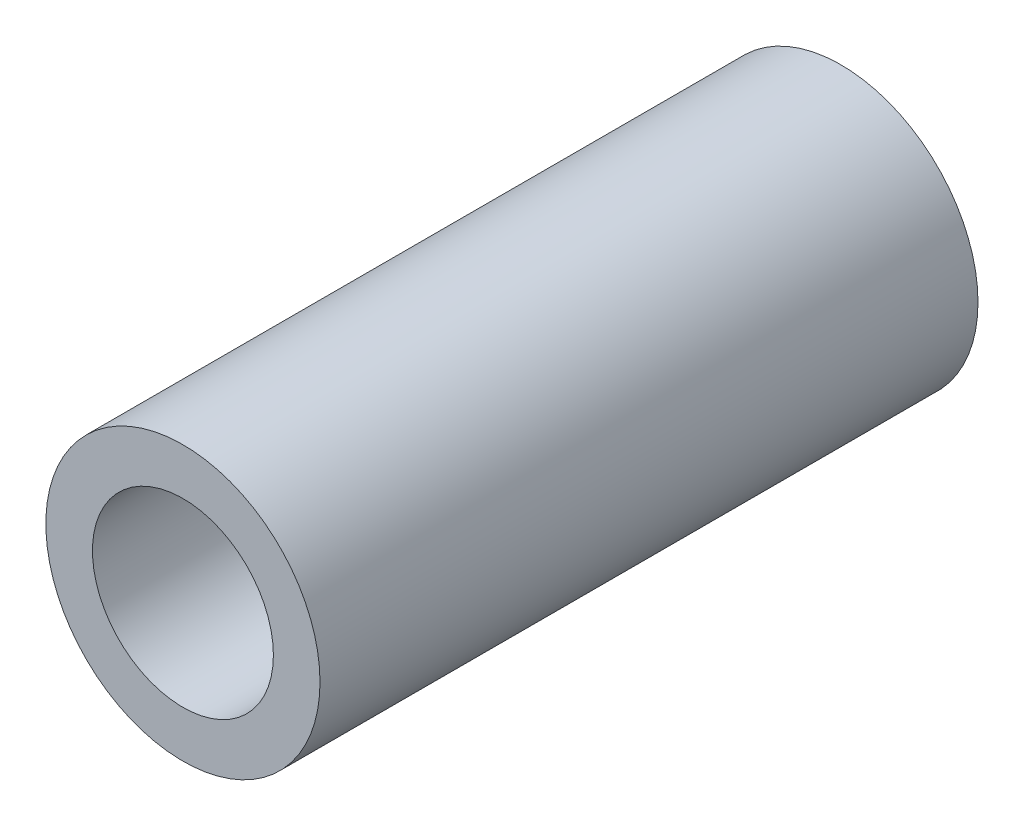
ISO-10303-21;
HEADER;
FILE_DESCRIPTION(('STEP AP214'),'2;1');
FILE_NAME('part.step','',(''),(''),'','','');
FILE_SCHEMA(('AUTOMOTIVE_DESIGN { 1 0 10303 214 1 1 1 1 }'));
ENDSEC;
DATA;
#1=APPLICATION_CONTEXT('core data for automotive mechanical design processes');
#2=APPLICATION_PROTOCOL_DEFINITION('international standard','automotive_design',2000,#1);
#3=PRODUCT_CONTEXT('',#1,'mechanical');
#4=PRODUCT('Part','Part','',(#3));
#5=PRODUCT_RELATED_PRODUCT_CATEGORY('part','',(#4));
#6=PRODUCT_DEFINITION_FORMATION('','',#4);
#7=PRODUCT_DEFINITION_CONTEXT('part definition',#1,'design');
#8=PRODUCT_DEFINITION('design','',#6,#7);
#9=PRODUCT_DEFINITION_SHAPE('','',#8);
#10=(LENGTH_UNIT() NAMED_UNIT(*) SI_UNIT(.MILLI.,.METRE.));
#11=(NAMED_UNIT(*) PLANE_ANGLE_UNIT() SI_UNIT($,.RADIAN.));
#12=(NAMED_UNIT(*) SI_UNIT($,.STERADIAN.) SOLID_ANGLE_UNIT());
#13=UNCERTAINTY_MEASURE_WITH_UNIT(LENGTH_MEASURE(1.E-05),#10,'distance_accuracy_value','');
#14=(GEOMETRIC_REPRESENTATION_CONTEXT(3) GLOBAL_UNCERTAINTY_ASSIGNED_CONTEXT((#13)) GLOBAL_UNIT_ASSIGNED_CONTEXT((#10,
#11,#12)) REPRESENTATION_CONTEXT('',''));
#15=CARTESIAN_POINT('',(0.,0.,0.));
#16=DIRECTION('',(0.,0.,1.));
#17=DIRECTION('',(1.,0.,0.));
#18=AXIS2_PLACEMENT_3D('',#15,#16,#17);
#19=CARTESIAN_POINT('',(0.,0.,12.));
#20=DIRECTION('',(0.,0.,-1.));
#21=DIRECTION('',(-1.,0.,0.));
#22=AXIS2_PLACEMENT_3D('',#19,#20,#21);
#23=CYLINDRICAL_SURFACE('',#22,2.5);
#24=CARTESIAN_POINT('',(0.,0.,12.));
#25=DIRECTION('',(0.,0.,1.));
#26=DIRECTION('',(1.,0.,0.));
#27=AXIS2_PLACEMENT_3D('',#24,#25,#26);
#28=CIRCLE('',#27,2.5);
#29=CARTESIAN_POINT('',(2.5,0.,12.));
#30=VERTEX_POINT('',#29);
#31=EDGE_CURVE('E10',#30,#30,#28,.T.);
#32=ORIENTED_EDGE('',*,*,#31,.F.);
#33=EDGE_LOOP('',(#32));
#34=FACE_BOUND('',#33,.T.);
#35=CARTESIAN_POINT('',(0.,0.,0.));
#36=DIRECTION('',(0.,0.,1.));
#37=DIRECTION('',(1.,0.,0.));
#38=AXIS2_PLACEMENT_3D('',#35,#36,#37);
#39=CIRCLE('',#38,2.5);
#40=CARTESIAN_POINT('',(2.5,0.,0.));
#41=VERTEX_POINT('',#40);
#42=EDGE_CURVE('E35',#41,#41,#39,.T.);
#43=ORIENTED_EDGE('',*,*,#42,.T.);
#44=EDGE_LOOP('',(#43));
#45=FACE_BOUND('',#44,.T.);
#46=ADVANCED_FACE('F32',(#34,#45),#23,.T.);
#47=CARTESIAN_POINT('',(0.,0.,12.));
#48=DIRECTION('',(0.,0.,1.));
#49=DIRECTION('',(1.,0.,0.));
#50=AXIS2_PLACEMENT_3D('',#47,#48,#49);
#51=PLANE('',#50);
#52=CARTESIAN_POINT('',(0.,0.,12.));
#53=DIRECTION('',(0.,0.,1.));
#54=DIRECTION('',(1.,0.,0.));
#55=AXIS2_PLACEMENT_3D('',#52,#53,#54);
#56=CIRCLE('',#55,1.65);
#57=CARTESIAN_POINT('',(1.65,0.,12.));
#58=VERTEX_POINT('',#57);
#59=EDGE_CURVE('E46',#58,#58,#56,.T.);
#60=ORIENTED_EDGE('',*,*,#59,.F.);
#61=EDGE_LOOP('',(#60));
#62=FACE_BOUND('',#61,.T.);
#63=ORIENTED_EDGE('',*,*,#31,.T.);
#64=EDGE_LOOP('',(#63));
#65=FACE_BOUND('',#64,.T.);
#66=ADVANCED_FACE('F52',(#62,#65),#51,.T.);
#67=CARTESIAN_POINT('',(0.,0.,0.));
#68=DIRECTION('',(0.,0.,1.));
#69=DIRECTION('',(1.,0.,0.));
#70=AXIS2_PLACEMENT_3D('',#67,#68,#69);
#71=PLANE('',#70);
#72=CARTESIAN_POINT('',(0.,0.,0.));
#73=DIRECTION('',(0.,0.,1.));
#74=DIRECTION('',(1.,0.,0.));
#75=AXIS2_PLACEMENT_3D('',#72,#73,#74);
#76=CIRCLE('',#75,1.65);
#77=CARTESIAN_POINT('',(1.65,0.,0.));
#78=VERTEX_POINT('',#77);
#79=EDGE_CURVE('E42',#78,#78,#76,.T.);
#80=ORIENTED_EDGE('',*,*,#79,.T.);
#81=EDGE_LOOP('',(#80));
#82=FACE_BOUND('',#81,.T.);
#83=ORIENTED_EDGE('',*,*,#42,.F.);
#84=EDGE_LOOP('',(#83));
#85=FACE_BOUND('',#84,.T.);
#86=ADVANCED_FACE('F54',(#82,#85),#71,.F.);
#87=CARTESIAN_POINT('',(0.,0.,12.));
#88=DIRECTION('',(0.,0.,1.));
#89=DIRECTION('',(1.,0.,0.));
#90=AXIS2_PLACEMENT_3D('',#87,#88,#89);
#91=CYLINDRICAL_SURFACE('',#90,1.65);
#92=ORIENTED_EDGE('',*,*,#79,.F.);
#93=EDGE_LOOP('',(#92));
#94=FACE_BOUND('',#93,.T.);
#95=ORIENTED_EDGE('',*,*,#59,.T.);
#96=EDGE_LOOP('',(#95));
#97=FACE_BOUND('',#96,.T.);
#98=ADVANCED_FACE('F50',(#94,#97),#91,.F.);
#99=CLOSED_SHELL('',(#46,#66,#86,#98));
#100=MANIFOLD_SOLID_BREP('B2',#99);
#101=ADVANCED_BREP_SHAPE_REPRESENTATION('',(#18,#100),#14);
#102=SHAPE_DEFINITION_REPRESENTATION(#9,#101);
ENDSEC;
END-ISO-10303-21;
